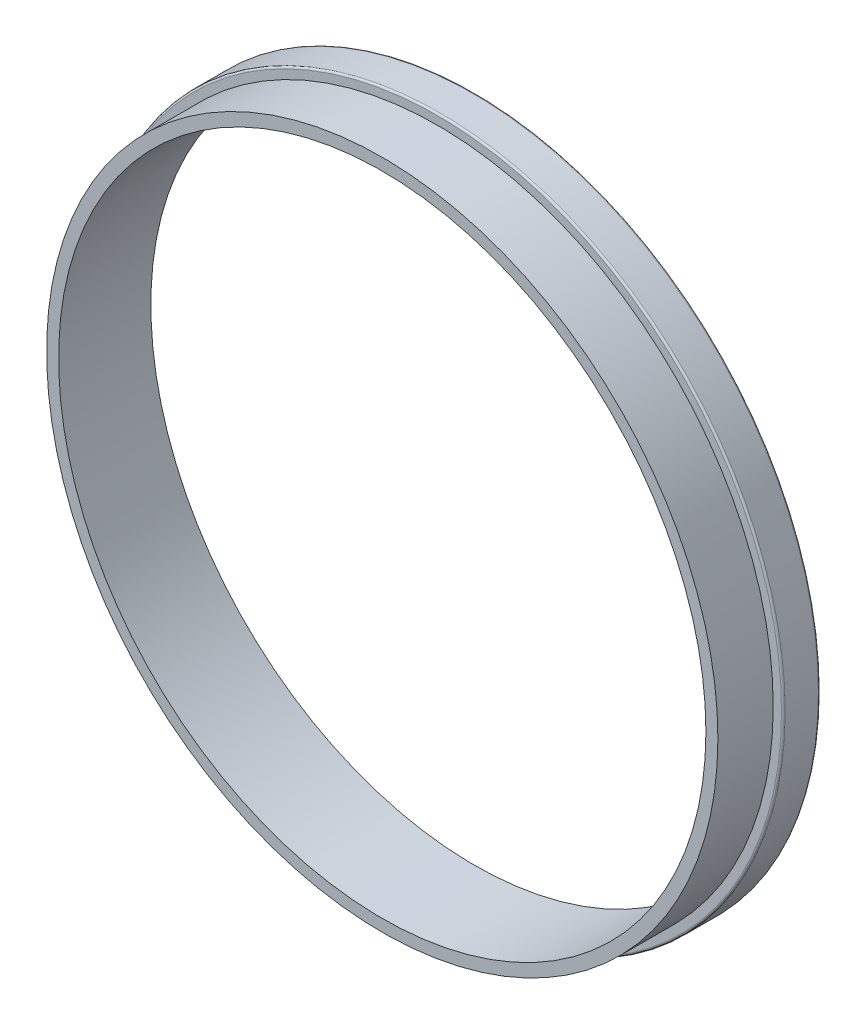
ISO-10303-21;
HEADER;
FILE_DESCRIPTION(('STEP AP214'),'2;1');
FILE_NAME('part.step','',(''),(''),'','','');
FILE_SCHEMA(('AUTOMOTIVE_DESIGN { 1 0 10303 214 1 1 1 1 }'));
ENDSEC;
DATA;
#1=APPLICATION_CONTEXT('core data for automotive mechanical design processes');
#2=APPLICATION_PROTOCOL_DEFINITION('international standard','automotive_design',2000,#1);
#3=PRODUCT_CONTEXT('',#1,'mechanical');
#4=PRODUCT('Part','Part','',(#3));
#5=PRODUCT_RELATED_PRODUCT_CATEGORY('part','',(#4));
#6=PRODUCT_DEFINITION_FORMATION('','',#4);
#7=PRODUCT_DEFINITION_CONTEXT('part definition',#1,'design');
#8=PRODUCT_DEFINITION('design','',#6,#7);
#9=PRODUCT_DEFINITION_SHAPE('','',#8);
#10=(LENGTH_UNIT() NAMED_UNIT(*) SI_UNIT(.MILLI.,.METRE.));
#11=(NAMED_UNIT(*) PLANE_ANGLE_UNIT() SI_UNIT($,.RADIAN.));
#12=(NAMED_UNIT(*) SI_UNIT($,.STERADIAN.) SOLID_ANGLE_UNIT());
#13=UNCERTAINTY_MEASURE_WITH_UNIT(LENGTH_MEASURE(1.E-05),#10,'distance_accuracy_value','');
#14=(GEOMETRIC_REPRESENTATION_CONTEXT(3) GLOBAL_UNCERTAINTY_ASSIGNED_CONTEXT((#13)) GLOBAL_UNIT_ASSIGNED_CONTEXT((#10,
#11,#12)) REPRESENTATION_CONTEXT('',''));
#15=CARTESIAN_POINT('',(0.,0.,0.));
#16=DIRECTION('',(0.,0.,1.));
#17=DIRECTION('',(1.,0.,0.));
#18=AXIS2_PLACEMENT_3D('',#15,#16,#17);
#19=CARTESIAN_POINT('',(0.,0.,10.));
#20=DIRECTION('',(0.,0.,1.));
#21=DIRECTION('',(1.,0.,0.));
#22=AXIS2_PLACEMENT_3D('',#19,#20,#21);
#23=PLANE('',#22);
#24=CARTESIAN_POINT('',(0.,0.,10.));
#25=DIRECTION('',(0.,0.,1.));
#26=DIRECTION('',(1.,0.,0.));
#27=AXIS2_PLACEMENT_3D('',#24,#25,#26);
#28=CIRCLE('',#27,35.1);
#29=CARTESIAN_POINT('',(35.1,0.,10.));
#30=VERTEX_POINT('',#29);
#31=EDGE_CURVE('E70',#30,#30,#28,.T.);
#32=ORIENTED_EDGE('',*,*,#31,.F.);
#33=EDGE_LOOP('',(#32));
#34=FACE_BOUND('',#33,.T.);
#35=CARTESIAN_POINT('',(0.,0.,10.));
#36=DIRECTION('',(0.,0.,1.));
#37=DIRECTION('',(1.,0.,0.));
#38=AXIS2_PLACEMENT_3D('',#35,#36,#37);
#39=CIRCLE('',#38,36.4);
#40=CARTESIAN_POINT('',(36.4,0.,10.));
#41=VERTEX_POINT('',#40);
#42=EDGE_CURVE('E79',#41,#41,#39,.T.);
#43=ORIENTED_EDGE('',*,*,#42,.T.);
#44=EDGE_LOOP('',(#43));
#45=FACE_BOUND('',#44,.T.);
#46=ADVANCED_FACE('F50',(#34,#45),#23,.T.);
#47=CARTESIAN_POINT('',(0.,0.,10.));
#48=DIRECTION('',(0.,0.,-1.));
#49=DIRECTION('',(-1.,0.,0.));
#50=AXIS2_PLACEMENT_3D('',#47,#48,#49);
#51=CYLINDRICAL_SURFACE('',#50,37.5);
#52=CARTESIAN_POINT('',(0.,0.,3.8));
#53=DIRECTION('',(0.,0.,1.));
#54=DIRECTION('',(1.,0.,0.));
#55=AXIS2_PLACEMENT_3D('',#52,#53,#54);
#56=CIRCLE('',#55,37.5);
#57=CARTESIAN_POINT('',(37.5,0.,3.8));
#58=VERTEX_POINT('',#57);
#59=EDGE_CURVE('E57',#58,#58,#56,.F.);
#60=ORIENTED_EDGE('',*,*,#59,.T.);
#61=EDGE_LOOP('',(#60));
#62=FACE_BOUND('',#61,.T.);
#63=CARTESIAN_POINT('',(0.,0.,0.200000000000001));
#64=DIRECTION('',(0.,0.,1.));
#65=DIRECTION('',(1.,0.,0.));
#66=AXIS2_PLACEMENT_3D('',#63,#64,#65);
#67=CIRCLE('',#66,37.5);
#68=CARTESIAN_POINT('',(37.5,0.,0.200000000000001));
#69=VERTEX_POINT('',#68);
#70=EDGE_CURVE('E61',#69,#69,#67,.T.);
#71=ORIENTED_EDGE('',*,*,#70,.T.);
#72=EDGE_LOOP('',(#71));
#73=FACE_BOUND('',#72,.T.);
#74=ADVANCED_FACE('F102',(#62,#73),#51,.T.);
#75=CARTESIAN_POINT('',(0.,0.,0.));
#76=DIRECTION('',(0.,0.,1.));
#77=DIRECTION('',(1.,0.,0.));
#78=AXIS2_PLACEMENT_3D('',#75,#76,#77);
#79=PLANE('',#78);
#80=CARTESIAN_POINT('',(0.,0.,0.));
#81=DIRECTION('',(0.,0.,1.));
#82=DIRECTION('',(1.,0.,0.));
#83=AXIS2_PLACEMENT_3D('',#80,#81,#82);
#84=CIRCLE('',#83,37.3);
#85=CARTESIAN_POINT('',(37.3,0.,0.));
#86=VERTEX_POINT('',#85);
#87=EDGE_CURVE('E14',#86,#86,#84,.F.);
#88=ORIENTED_EDGE('',*,*,#87,.T.);
#89=EDGE_LOOP('',(#88));
#90=FACE_BOUND('',#89,.T.);
#91=CARTESIAN_POINT('',(0.,0.,0.));
#92=DIRECTION('',(0.,0.,1.));
#93=DIRECTION('',(1.,0.,0.));
#94=AXIS2_PLACEMENT_3D('',#91,#92,#93);
#95=CIRCLE('',#94,35.1);
#96=CARTESIAN_POINT('',(35.1,0.,0.));
#97=VERTEX_POINT('',#96);
#98=EDGE_CURVE('E71',#97,#97,#95,.T.);
#99=ORIENTED_EDGE('',*,*,#98,.T.);
#100=EDGE_LOOP('',(#99));
#101=FACE_BOUND('',#100,.T.);
#102=ADVANCED_FACE('F109',(#90,#101),#79,.F.);
#103=CARTESIAN_POINT('',(0.,0.,10.));
#104=DIRECTION('',(0.,0.,-1.));
#105=DIRECTION('',(-1.,0.,0.));
#106=AXIS2_PLACEMENT_3D('',#103,#104,#105);
#107=CYLINDRICAL_SURFACE('',#106,35.1);
#108=ORIENTED_EDGE('',*,*,#31,.T.);
#109=EDGE_LOOP('',(#108));
#110=FACE_BOUND('',#109,.T.);
#111=ORIENTED_EDGE('',*,*,#98,.F.);
#112=EDGE_LOOP('',(#111));
#113=FACE_BOUND('',#112,.T.);
#114=ADVANCED_FACE('F96',(#110,#113),#107,.F.);
#115=CARTESIAN_POINT('',(0.,0.,4.));
#116=DIRECTION('',(0.,0.,1.));
#117=DIRECTION('',(1.,0.,0.));
#118=AXIS2_PLACEMENT_3D('',#115,#116,#117);
#119=PLANE('',#118);
#120=CARTESIAN_POINT('',(0.,0.,4.));
#121=DIRECTION('',(0.,0.,1.));
#122=DIRECTION('',(1.,0.,0.));
#123=AXIS2_PLACEMENT_3D('',#120,#121,#122);
#124=CIRCLE('',#123,37.3);
#125=CARTESIAN_POINT('',(37.3,0.,4.));
#126=VERTEX_POINT('',#125);
#127=EDGE_CURVE('E65',#126,#126,#124,.T.);
#128=ORIENTED_EDGE('',*,*,#127,.T.);
#129=EDGE_LOOP('',(#128));
#130=FACE_BOUND('',#129,.T.);
#131=CARTESIAN_POINT('',(0.,0.,4.));
#132=DIRECTION('',(0.,0.,1.));
#133=DIRECTION('',(1.,0.,0.));
#134=AXIS2_PLACEMENT_3D('',#131,#132,#133);
#135=CIRCLE('',#134,36.4);
#136=CARTESIAN_POINT('',(36.4,0.,4.));
#137=VERTEX_POINT('',#136);
#138=EDGE_CURVE('E74',#137,#137,#135,.F.);
#139=ORIENTED_EDGE('',*,*,#138,.T.);
#140=EDGE_LOOP('',(#139));
#141=FACE_BOUND('',#140,.T.);
#142=ADVANCED_FACE('F87',(#130,#141),#119,.T.);
#143=CARTESIAN_POINT('',(0.,0.,-107.625318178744));
#144=DIRECTION('',(0.,0.,1.));
#145=DIRECTION('',(1.,0.,0.));
#146=AXIS2_PLACEMENT_3D('',#143,#144,#145);
#147=CYLINDRICAL_SURFACE('',#146,36.4);
#148=ORIENTED_EDGE('',*,*,#138,.F.);
#149=EDGE_LOOP('',(#148));
#150=FACE_BOUND('',#149,.T.);
#151=ORIENTED_EDGE('',*,*,#42,.F.);
#152=EDGE_LOOP('',(#151));
#153=FACE_BOUND('',#152,.T.);
#154=ADVANCED_FACE('F84',(#150,#153),#147,.T.);
#155=CARTESIAN_POINT('',(0.,0.,3.8));
#156=DIRECTION('',(0.,0.,1.));
#157=DIRECTION('',(1.,0.,0.));
#158=AXIS2_PLACEMENT_3D('',#155,#156,#157);
#159=TOROIDAL_SURFACE('',#158,37.3,0.2);
#160=ORIENTED_EDGE('',*,*,#59,.F.);
#161=EDGE_LOOP('',(#160));
#162=FACE_BOUND('',#161,.T.);
#163=ORIENTED_EDGE('',*,*,#127,.F.);
#164=EDGE_LOOP('',(#163));
#165=FACE_BOUND('',#164,.T.);
#166=ADVANCED_FACE('F86',(#162,#165),#159,.T.);
#167=CARTESIAN_POINT('',(0.,0.,0.200000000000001));
#168=DIRECTION('',(0.,0.,1.));
#169=DIRECTION('',(1.,0.,0.));
#170=AXIS2_PLACEMENT_3D('',#167,#168,#169);
#171=TOROIDAL_SURFACE('',#170,37.3,0.2);
#172=ORIENTED_EDGE('',*,*,#87,.F.);
#173=EDGE_LOOP('',(#172));
#174=FACE_BOUND('',#173,.T.);
#175=ORIENTED_EDGE('',*,*,#70,.F.);
#176=EDGE_LOOP('',(#175));
#177=FACE_BOUND('',#176,.T.);
#178=ADVANCED_FACE('F52',(#174,#177),#171,.T.);
#179=CLOSED_SHELL('',(#46,#74,#102,#114,#142,#154,#166,#178));
#180=MANIFOLD_SOLID_BREP('B2',#179);
#181=ADVANCED_BREP_SHAPE_REPRESENTATION('',(#18,#180),#14);
#182=SHAPE_DEFINITION_REPRESENTATION(#9,#181);
ENDSEC;
END-ISO-10303-21;
